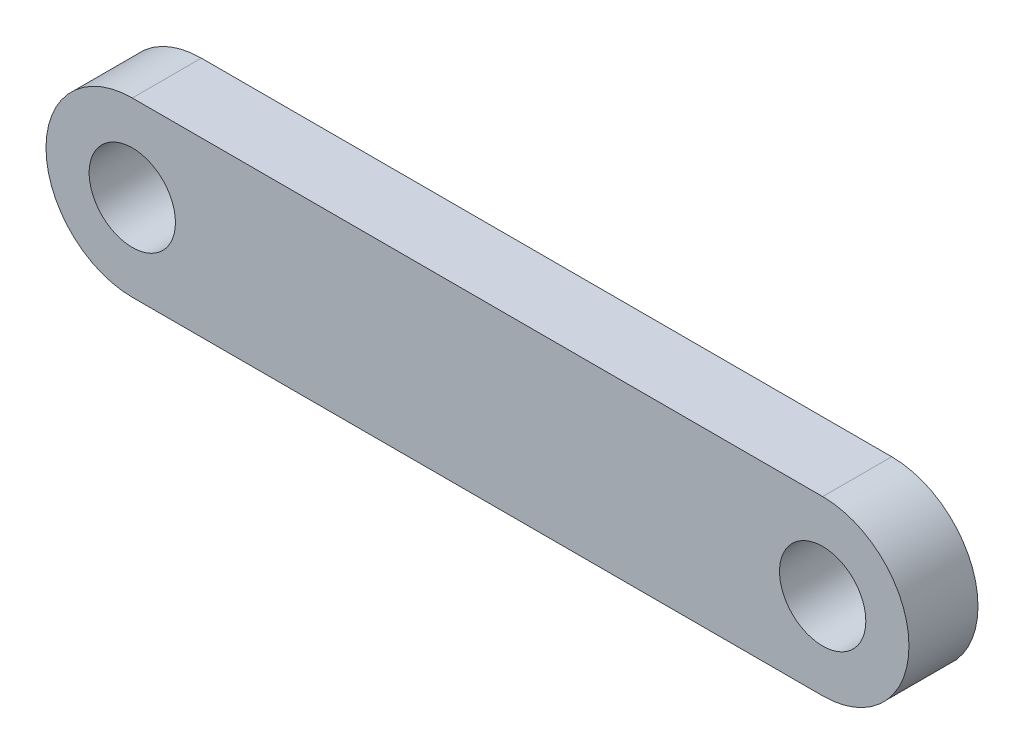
ISO-10303-21;
HEADER;
FILE_DESCRIPTION(('STEP AP214'),'2;1');
FILE_NAME('part.step','',(''),(''),'','','');
FILE_SCHEMA(('AUTOMOTIVE_DESIGN { 1 0 10303 214 1 1 1 1 }'));
ENDSEC;
DATA;
#1=APPLICATION_CONTEXT('core data for automotive mechanical design processes');
#2=APPLICATION_PROTOCOL_DEFINITION('international standard','automotive_design',2000,#1);
#3=PRODUCT_CONTEXT('',#1,'mechanical');
#4=PRODUCT('Part','Part','',(#3));
#5=PRODUCT_RELATED_PRODUCT_CATEGORY('part','',(#4));
#6=PRODUCT_DEFINITION_FORMATION('','',#4);
#7=PRODUCT_DEFINITION_CONTEXT('part definition',#1,'design');
#8=PRODUCT_DEFINITION('design','',#6,#7);
#9=PRODUCT_DEFINITION_SHAPE('','',#8);
#10=(LENGTH_UNIT() NAMED_UNIT(*) SI_UNIT(.MILLI.,.METRE.));
#11=(NAMED_UNIT(*) PLANE_ANGLE_UNIT() SI_UNIT($,.RADIAN.));
#12=(NAMED_UNIT(*) SI_UNIT($,.STERADIAN.) SOLID_ANGLE_UNIT());
#13=UNCERTAINTY_MEASURE_WITH_UNIT(LENGTH_MEASURE(1.E-05),#10,'distance_accuracy_value','');
#14=(GEOMETRIC_REPRESENTATION_CONTEXT(3) GLOBAL_UNCERTAINTY_ASSIGNED_CONTEXT((#13)) GLOBAL_UNIT_ASSIGNED_CONTEXT((#10,
#11,#12)) REPRESENTATION_CONTEXT('',''));
#15=CARTESIAN_POINT('',(0.,0.,0.));
#16=DIRECTION('',(0.,0.,1.));
#17=DIRECTION('',(1.,0.,0.));
#18=AXIS2_PLACEMENT_3D('',#15,#16,#17);
#19=CARTESIAN_POINT('',(0.,-5.,2.));
#20=DIRECTION('',(0.,0.,-1.));
#21=DIRECTION('',(-1.,0.,0.));
#22=AXIS2_PLACEMENT_3D('',#19,#20,#21);
#23=PLANE('',#22);
#24=CARTESIAN_POINT('',(0.,-5.,2.));
#25=DIRECTION('',(0.,0.,1.));
#26=DIRECTION('',(1.,0.,0.));
#27=AXIS2_PLACEMENT_3D('',#24,#25,#26);
#28=CIRCLE('',#27,2.5);
#29=CARTESIAN_POINT('',(2.5,-5.,2.));
#30=VERTEX_POINT('',#29);
#31=EDGE_CURVE('E92',#30,#30,#28,.T.);
#32=ORIENTED_EDGE('',*,*,#31,.F.);
#33=EDGE_LOOP('',(#32));
#34=FACE_BOUND('',#33,.T.);
#35=CARTESIAN_POINT('',(0.,-5.,2.));
#36=DIRECTION('',(0.,0.,1.));
#37=DIRECTION('',(-1.,0.,0.));
#38=AXIS2_PLACEMENT_3D('',#35,#36,#37);
#39=CIRCLE('',#38,5.);
#40=CARTESIAN_POINT('',(0.,0.,2.));
#41=VERTEX_POINT('',#40);
#42=CARTESIAN_POINT('',(0.,-10.,2.));
#43=VERTEX_POINT('',#42);
#44=EDGE_CURVE('E102',#41,#43,#39,.T.);
#45=ORIENTED_EDGE('',*,*,#44,.T.);
#46=DIRECTION('',(1.,0.,0.));
#47=VECTOR('',#46,1.);
#48=CARTESIAN_POINT('',(40.,-9.99999999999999,2.));
#49=LINE('',#48,#47);
#50=CARTESIAN_POINT('',(40.,-9.99999999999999,2.));
#51=VERTEX_POINT('',#50);
#52=EDGE_CURVE('E87',#43,#51,#49,.T.);
#53=ORIENTED_EDGE('',*,*,#52,.T.);
#54=CARTESIAN_POINT('',(40.,-5.,2.));
#55=DIRECTION('',(0.,0.,1.));
#56=DIRECTION('',(-1.,0.,0.));
#57=AXIS2_PLACEMENT_3D('',#54,#55,#56);
#58=CIRCLE('',#57,5.);
#59=CARTESIAN_POINT('',(40.,0.,2.));
#60=VERTEX_POINT('',#59);
#61=EDGE_CURVE('E53',#51,#60,#58,.T.);
#62=ORIENTED_EDGE('',*,*,#61,.T.);
#63=DIRECTION('',(-1.,0.,0.));
#64=VECTOR('',#63,1.);
#65=CARTESIAN_POINT('',(0.,0.,2.));
#66=LINE('',#65,#64);
#67=EDGE_CURVE('E48',#60,#41,#66,.T.);
#68=ORIENTED_EDGE('',*,*,#67,.T.);
#69=EDGE_LOOP('',(#45,#53,#62,#68));
#70=FACE_BOUND('',#69,.T.);
#71=CARTESIAN_POINT('',(40.,-5.,2.));
#72=DIRECTION('',(0.,0.,1.));
#73=DIRECTION('',(1.,0.,0.));
#74=AXIS2_PLACEMENT_3D('',#71,#72,#73);
#75=CIRCLE('',#74,2.5);
#76=CARTESIAN_POINT('',(42.5,-5.,2.));
#77=VERTEX_POINT('',#76);
#78=EDGE_CURVE('E120',#77,#77,#75,.T.);
#79=ORIENTED_EDGE('',*,*,#78,.F.);
#80=EDGE_LOOP('',(#79));
#81=FACE_BOUND('',#80,.T.);
#82=ADVANCED_FACE('F33',(#34,#70,#81),#23,.F.);
#83=CARTESIAN_POINT('',(0.,-5.,-2.));
#84=DIRECTION('',(0.,0.,-1.));
#85=DIRECTION('',(-1.,0.,0.));
#86=AXIS2_PLACEMENT_3D('',#83,#84,#85);
#87=PLANE('',#86);
#88=CARTESIAN_POINT('',(0.,-5.,-2.));
#89=DIRECTION('',(0.,0.,1.));
#90=DIRECTION('',(1.,0.,0.));
#91=AXIS2_PLACEMENT_3D('',#88,#89,#90);
#92=CIRCLE('',#91,2.5);
#93=CARTESIAN_POINT('',(2.5,-5.,-2.));
#94=VERTEX_POINT('',#93);
#95=EDGE_CURVE('E95',#94,#94,#92,.T.);
#96=ORIENTED_EDGE('',*,*,#95,.T.);
#97=EDGE_LOOP('',(#96));
#98=FACE_BOUND('',#97,.T.);
#99=CARTESIAN_POINT('',(0.,-5.,-2.));
#100=DIRECTION('',(0.,0.,1.));
#101=DIRECTION('',(-1.,0.,0.));
#102=AXIS2_PLACEMENT_3D('',#99,#100,#101);
#103=CIRCLE('',#102,5.);
#104=CARTESIAN_POINT('',(0.,0.,-2.));
#105=VERTEX_POINT('',#104);
#106=CARTESIAN_POINT('',(0.,-10.,-2.));
#107=VERTEX_POINT('',#106);
#108=EDGE_CURVE('E79',#105,#107,#103,.T.);
#109=ORIENTED_EDGE('',*,*,#108,.F.);
#110=DIRECTION('',(-1.,0.,0.));
#111=VECTOR('',#110,1.);
#112=CARTESIAN_POINT('',(0.,0.,-2.));
#113=LINE('',#112,#111);
#114=CARTESIAN_POINT('',(40.,0.,-2.));
#115=VERTEX_POINT('',#114);
#116=EDGE_CURVE('E100',#115,#105,#113,.T.);
#117=ORIENTED_EDGE('',*,*,#116,.F.);
#118=CARTESIAN_POINT('',(40.,-5.,-2.));
#119=DIRECTION('',(0.,0.,1.));
#120=DIRECTION('',(-1.,0.,0.));
#121=AXIS2_PLACEMENT_3D('',#118,#119,#120);
#122=CIRCLE('',#121,5.);
#123=CARTESIAN_POINT('',(40.,-9.99999999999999,-2.));
#124=VERTEX_POINT('',#123);
#125=EDGE_CURVE('E80',#124,#115,#122,.T.);
#126=ORIENTED_EDGE('',*,*,#125,.F.);
#127=DIRECTION('',(1.,0.,0.));
#128=VECTOR('',#127,1.);
#129=CARTESIAN_POINT('',(40.,-9.99999999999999,-2.));
#130=LINE('',#129,#128);
#131=EDGE_CURVE('E74',#107,#124,#130,.T.);
#132=ORIENTED_EDGE('',*,*,#131,.F.);
#133=EDGE_LOOP('',(#109,#117,#126,#132));
#134=FACE_BOUND('',#133,.T.);
#135=CARTESIAN_POINT('',(40.,-5.,-2.));
#136=DIRECTION('',(0.,0.,1.));
#137=DIRECTION('',(1.,0.,0.));
#138=AXIS2_PLACEMENT_3D('',#135,#136,#137);
#139=CIRCLE('',#138,2.5);
#140=CARTESIAN_POINT('',(42.5,-5.,-2.));
#141=VERTEX_POINT('',#140);
#142=EDGE_CURVE('E122',#141,#141,#139,.T.);
#143=ORIENTED_EDGE('',*,*,#142,.T.);
#144=EDGE_LOOP('',(#143));
#145=FACE_BOUND('',#144,.T.);
#146=ADVANCED_FACE('F75',(#98,#134,#145),#87,.T.);
#147=CARTESIAN_POINT('',(0.,-5.,2.));
#148=DIRECTION('',(0.,0.,-1.));
#149=DIRECTION('',(-1.,0.,0.));
#150=AXIS2_PLACEMENT_3D('',#147,#148,#149);
#151=CYLINDRICAL_SURFACE('',#150,5.);
#152=ORIENTED_EDGE('',*,*,#108,.T.);
#153=DIRECTION('',(0.,0.,-1.));
#154=VECTOR('',#153,1.);
#155=CARTESIAN_POINT('',(0.,-10.,2.));
#156=LINE('',#155,#154);
#157=EDGE_CURVE('E11',#43,#107,#156,.T.);
#158=ORIENTED_EDGE('',*,*,#157,.F.);
#159=ORIENTED_EDGE('',*,*,#44,.F.);
#160=DIRECTION('',(0.,0.,-1.));
#161=VECTOR('',#160,1.);
#162=CARTESIAN_POINT('',(0.,0.,2.));
#163=LINE('',#162,#161);
#164=EDGE_CURVE('E91',#41,#105,#163,.T.);
#165=ORIENTED_EDGE('',*,*,#164,.T.);
#166=EDGE_LOOP('',(#152,#158,#159,#165));
#167=FACE_BOUND('',#166,.T.);
#168=ADVANCED_FACE('F35',(#167),#151,.T.);
#169=CARTESIAN_POINT('',(40.,-9.99999999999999,2.));
#170=DIRECTION('',(0.,1.,0.));
#171=DIRECTION('',(-1.,0.,0.));
#172=AXIS2_PLACEMENT_3D('',#169,#170,#171);
#173=PLANE('',#172);
#174=ORIENTED_EDGE('',*,*,#131,.T.);
#175=DIRECTION('',(0.,0.,-1.));
#176=VECTOR('',#175,1.);
#177=CARTESIAN_POINT('',(40.,-9.99999999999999,2.));
#178=LINE('',#177,#176);
#179=EDGE_CURVE('E41',#51,#124,#178,.T.);
#180=ORIENTED_EDGE('',*,*,#179,.F.);
#181=ORIENTED_EDGE('',*,*,#52,.F.);
#182=ORIENTED_EDGE('',*,*,#157,.T.);
#183=EDGE_LOOP('',(#174,#180,#181,#182));
#184=FACE_BOUND('',#183,.T.);
#185=ADVANCED_FACE('F86',(#184),#173,.F.);
#186=CARTESIAN_POINT('',(40.,-5.,2.));
#187=DIRECTION('',(0.,0.,-1.));
#188=DIRECTION('',(-1.,0.,0.));
#189=AXIS2_PLACEMENT_3D('',#186,#187,#188);
#190=CYLINDRICAL_SURFACE('',#189,5.);
#191=ORIENTED_EDGE('',*,*,#125,.T.);
#192=DIRECTION('',(0.,0.,-1.));
#193=VECTOR('',#192,1.);
#194=CARTESIAN_POINT('',(40.,0.,2.));
#195=LINE('',#194,#193);
#196=EDGE_CURVE('E108',#60,#115,#195,.T.);
#197=ORIENTED_EDGE('',*,*,#196,.F.);
#198=ORIENTED_EDGE('',*,*,#61,.F.);
#199=ORIENTED_EDGE('',*,*,#179,.T.);
#200=EDGE_LOOP('',(#191,#197,#198,#199));
#201=FACE_BOUND('',#200,.T.);
#202=ADVANCED_FACE('F111',(#201),#190,.T.);
#203=CARTESIAN_POINT('',(0.,0.,2.));
#204=DIRECTION('',(0.,-1.,0.));
#205=DIRECTION('',(0.,0.,-1.));
#206=AXIS2_PLACEMENT_3D('',#203,#204,#205);
#207=PLANE('',#206);
#208=ORIENTED_EDGE('',*,*,#116,.T.);
#209=ORIENTED_EDGE('',*,*,#164,.F.);
#210=ORIENTED_EDGE('',*,*,#67,.F.);
#211=ORIENTED_EDGE('',*,*,#196,.T.);
#212=EDGE_LOOP('',(#208,#209,#210,#211));
#213=FACE_BOUND('',#212,.T.);
#214=ADVANCED_FACE('F113',(#213),#207,.F.);
#215=CARTESIAN_POINT('',(0.,-5.,2.));
#216=DIRECTION('',(0.,0.,-1.));
#217=DIRECTION('',(-1.,0.,0.));
#218=AXIS2_PLACEMENT_3D('',#215,#216,#217);
#219=CYLINDRICAL_SURFACE('',#218,2.5);
#220=ORIENTED_EDGE('',*,*,#31,.T.);
#221=EDGE_LOOP('',(#220));
#222=FACE_BOUND('',#221,.T.);
#223=ORIENTED_EDGE('',*,*,#95,.F.);
#224=EDGE_LOOP('',(#223));
#225=FACE_BOUND('',#224,.T.);
#226=ADVANCED_FACE('F131',(#222,#225),#219,.F.);
#227=CARTESIAN_POINT('',(40.,-5.,2.));
#228=DIRECTION('',(0.,0.,-1.));
#229=DIRECTION('',(-1.,0.,0.));
#230=AXIS2_PLACEMENT_3D('',#227,#228,#229);
#231=CYLINDRICAL_SURFACE('',#230,2.5);
#232=ORIENTED_EDGE('',*,*,#78,.T.);
#233=EDGE_LOOP('',(#232));
#234=FACE_BOUND('',#233,.T.);
#235=ORIENTED_EDGE('',*,*,#142,.F.);
#236=EDGE_LOOP('',(#235));
#237=FACE_BOUND('',#236,.T.);
#238=ADVANCED_FACE('F129',(#234,#237),#231,.F.);
#239=CLOSED_SHELL('',(#82,#146,#168,#185,#202,#214,#226,#238));
#240=MANIFOLD_SOLID_BREP('B2',#239);
#241=ADVANCED_BREP_SHAPE_REPRESENTATION('',(#18,#240),#14);
#242=SHAPE_DEFINITION_REPRESENTATION(#9,#241);
ENDSEC;
END-ISO-10303-21;
